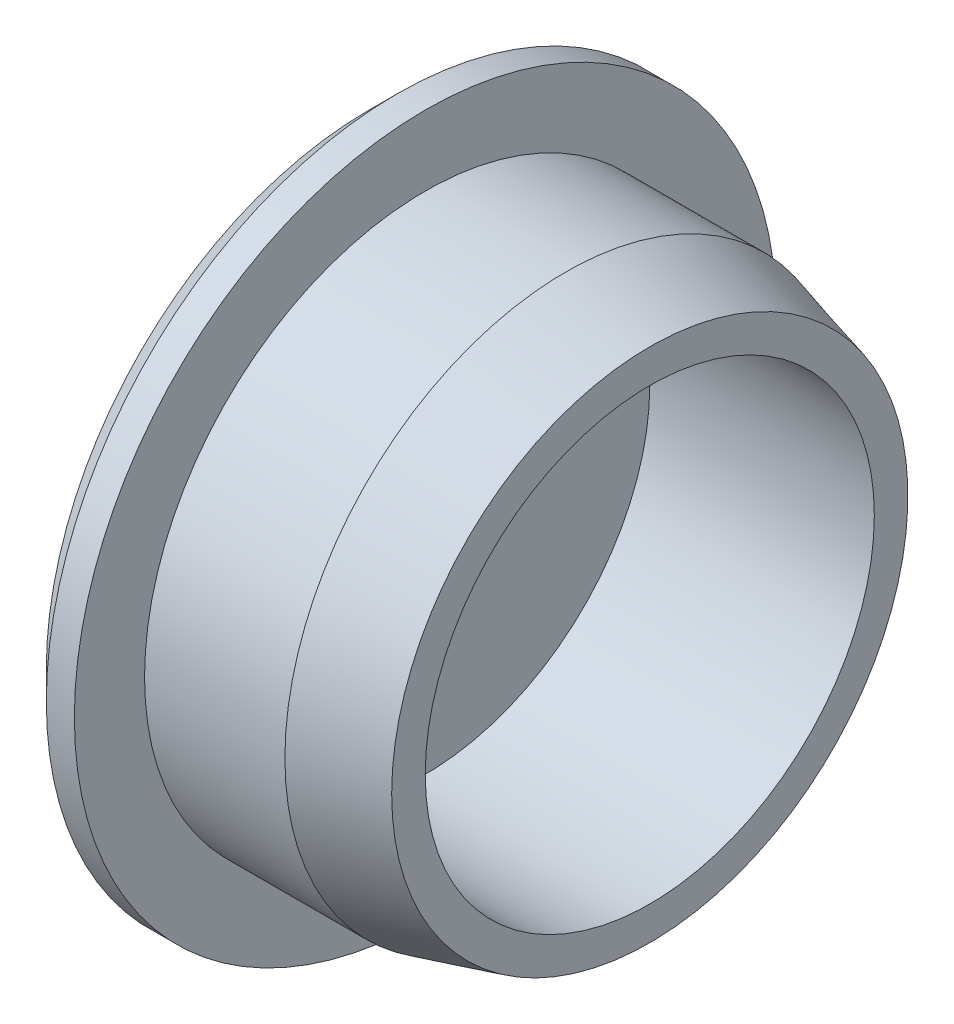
from build123d import *


with BuildPart() as part:
    # Esquisse1 → R_volution1 (revolve)
    with BuildSketch(Plane.XY, mode=Mode.PRIVATE) as r_volution1_sk:
        Polygon((0, 9.196152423), (-3, 10), (-8, 10), (-8, 12.5), (-9, 12.5), (-10, 11.5), (-10, 0), (-8, 0), (-8, 8), (0, 8), align=None)
    revolve(r_volution1_sk.sketch.rotate(Axis((-10, 0, 0), (1, 0, 0)), 90), axis=Axis((-10, 0, 0), (1, 0, 0)))


solid = part.part
